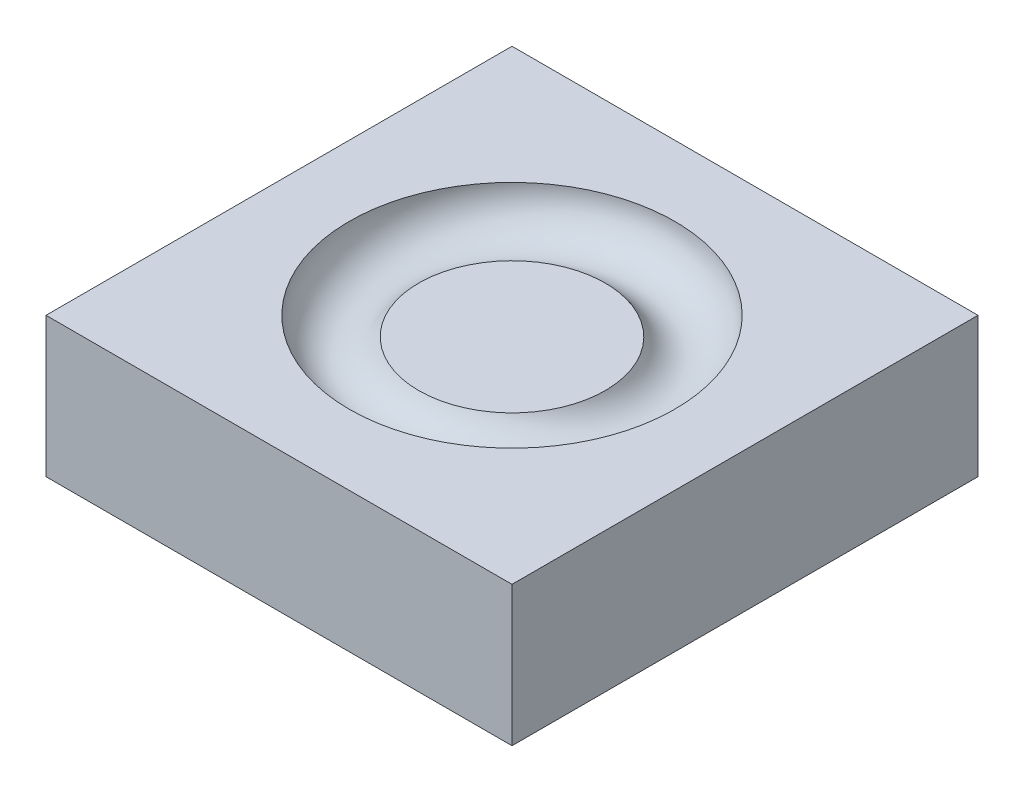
ISO-10303-21;
HEADER;
FILE_DESCRIPTION(('STEP AP214'),'2;1');
FILE_NAME('part.step','',(''),(''),'','','');
FILE_SCHEMA(('AUTOMOTIVE_DESIGN { 1 0 10303 214 1 1 1 1 }'));
ENDSEC;
DATA;
#1=APPLICATION_CONTEXT('core data for automotive mechanical design processes');
#2=APPLICATION_PROTOCOL_DEFINITION('international standard','automotive_design',2000,#1);
#3=PRODUCT_CONTEXT('',#1,'mechanical');
#4=PRODUCT('Part','Part','',(#3));
#5=PRODUCT_RELATED_PRODUCT_CATEGORY('part','',(#4));
#6=PRODUCT_DEFINITION_FORMATION('','',#4);
#7=PRODUCT_DEFINITION_CONTEXT('part definition',#1,'design');
#8=PRODUCT_DEFINITION('design','',#6,#7);
#9=PRODUCT_DEFINITION_SHAPE('','',#8);
#10=(LENGTH_UNIT() NAMED_UNIT(*) SI_UNIT(.MILLI.,.METRE.));
#11=(NAMED_UNIT(*) PLANE_ANGLE_UNIT() SI_UNIT($,.RADIAN.));
#12=(NAMED_UNIT(*) SI_UNIT($,.STERADIAN.) SOLID_ANGLE_UNIT());
#13=UNCERTAINTY_MEASURE_WITH_UNIT(LENGTH_MEASURE(1.E-05),#10,'distance_accuracy_value','');
#14=(GEOMETRIC_REPRESENTATION_CONTEXT(3) GLOBAL_UNCERTAINTY_ASSIGNED_CONTEXT((#13)) GLOBAL_UNIT_ASSIGNED_CONTEXT((#10,
#11,#12)) REPRESENTATION_CONTEXT('',''));
#15=CARTESIAN_POINT('',(0.,0.,0.));
#16=DIRECTION('',(0.,0.,1.));
#17=DIRECTION('',(1.,0.,0.));
#18=AXIS2_PLACEMENT_3D('',#15,#16,#17);
#19=CARTESIAN_POINT('',(0.,-110.,0.));
#20=DIRECTION('',(0.,-1.,0.));
#21=DIRECTION('',(0.,0.,-1.));
#22=AXIS2_PLACEMENT_3D('',#19,#20,#21);
#23=PLANE('',#22);
#24=DIRECTION('',(0.,0.,1.));
#25=VECTOR('',#24,1.);
#26=CARTESIAN_POINT('',(50.,-110.,50.));
#27=LINE('',#26,#25);
#28=CARTESIAN_POINT('',(50.,-110.,-50.));
#29=VERTEX_POINT('',#28);
#30=CARTESIAN_POINT('',(50.,-110.,50.));
#31=VERTEX_POINT('',#30);
#32=EDGE_CURVE('E79',#29,#31,#27,.T.);
#33=ORIENTED_EDGE('',*,*,#32,.T.);
#34=DIRECTION('',(-1.,0.,0.));
#35=VECTOR('',#34,1.);
#36=CARTESIAN_POINT('',(-50.,-110.,50.));
#37=LINE('',#36,#35);
#38=CARTESIAN_POINT('',(-50.,-110.,50.));
#39=VERTEX_POINT('',#38);
#40=EDGE_CURVE('E86',#31,#39,#37,.T.);
#41=ORIENTED_EDGE('',*,*,#40,.T.);
#42=DIRECTION('',(0.,0.,-1.));
#43=VECTOR('',#42,1.);
#44=CARTESIAN_POINT('',(-50.,-110.,50.));
#45=LINE('',#44,#43);
#46=CARTESIAN_POINT('',(-50.,-110.,-50.));
#47=VERTEX_POINT('',#46);
#48=EDGE_CURVE('E92',#39,#47,#45,.T.);
#49=ORIENTED_EDGE('',*,*,#48,.T.);
#50=DIRECTION('',(1.,0.,0.));
#51=VECTOR('',#50,1.);
#52=CARTESIAN_POINT('',(-50.,-110.,-50.));
#53=LINE('',#52,#51);
#54=EDGE_CURVE('E84',#47,#29,#53,.T.);
#55=ORIENTED_EDGE('',*,*,#54,.T.);
#56=EDGE_LOOP('',(#33,#41,#49,#55));
#57=FACE_BOUND('',#56,.T.);
#58=ADVANCED_FACE('F36',(#57),#23,.T.);
#59=CARTESIAN_POINT('',(-50.,-50.,50.));
#60=DIRECTION('',(0.,0.,1.));
#61=DIRECTION('',(1.,0.,0.));
#62=AXIS2_PLACEMENT_3D('',#59,#60,#61);
#63=PLANE('',#62);
#64=DIRECTION('',(0.,-1.,0.));
#65=VECTOR('',#64,1.);
#66=CARTESIAN_POINT('',(50.,-50.,50.));
#67=LINE('',#66,#65);
#68=CARTESIAN_POINT('',(50.,-80.,50.));
#69=VERTEX_POINT('',#68);
#70=EDGE_CURVE('E75',#69,#31,#67,.T.);
#71=ORIENTED_EDGE('',*,*,#70,.F.);
#72=DIRECTION('',(-1.,0.,0.));
#73=VECTOR('',#72,1.);
#74=CARTESIAN_POINT('',(-50.,-80.,50.));
#75=LINE('',#74,#73);
#76=CARTESIAN_POINT('',(-50.,-80.,50.));
#77=VERTEX_POINT('',#76);
#78=EDGE_CURVE('E40',#69,#77,#75,.T.);
#79=ORIENTED_EDGE('',*,*,#78,.T.);
#80=DIRECTION('',(0.,-1.,0.));
#81=VECTOR('',#80,1.);
#82=CARTESIAN_POINT('',(-50.,-50.,50.));
#83=LINE('',#82,#81);
#84=EDGE_CURVE('E83',#77,#39,#83,.T.);
#85=ORIENTED_EDGE('',*,*,#84,.T.);
#86=ORIENTED_EDGE('',*,*,#40,.F.);
#87=EDGE_LOOP('',(#71,#79,#85,#86));
#88=FACE_BOUND('',#87,.T.);
#89=ADVANCED_FACE('F87',(#88),#63,.T.);
#90=CARTESIAN_POINT('',(-50.,-50.,50.));
#91=DIRECTION('',(-1.,0.,0.));
#92=DIRECTION('',(0.,0.,1.));
#93=AXIS2_PLACEMENT_3D('',#90,#91,#92);
#94=PLANE('',#93);
#95=ORIENTED_EDGE('',*,*,#84,.F.);
#96=DIRECTION('',(0.,0.,-1.));
#97=VECTOR('',#96,1.);
#98=CARTESIAN_POINT('',(-50.,-80.,50.));
#99=LINE('',#98,#97);
#100=CARTESIAN_POINT('',(-50.,-80.,-50.));
#101=VERTEX_POINT('',#100);
#102=EDGE_CURVE('E109',#77,#101,#99,.T.);
#103=ORIENTED_EDGE('',*,*,#102,.T.);
#104=DIRECTION('',(0.,-1.,0.));
#105=VECTOR('',#104,1.);
#106=CARTESIAN_POINT('',(-50.,-50.,-50.));
#107=LINE('',#106,#105);
#108=EDGE_CURVE('E103',#101,#47,#107,.T.);
#109=ORIENTED_EDGE('',*,*,#108,.T.);
#110=ORIENTED_EDGE('',*,*,#48,.F.);
#111=EDGE_LOOP('',(#95,#103,#109,#110));
#112=FACE_BOUND('',#111,.T.);
#113=ADVANCED_FACE('F108',(#112),#94,.T.);
#114=CARTESIAN_POINT('',(-50.,-50.,-50.));
#115=DIRECTION('',(0.,0.,-1.));
#116=DIRECTION('',(-1.,0.,0.));
#117=AXIS2_PLACEMENT_3D('',#114,#115,#116);
#118=PLANE('',#117);
#119=ORIENTED_EDGE('',*,*,#108,.F.);
#120=DIRECTION('',(1.,0.,0.));
#121=VECTOR('',#120,1.);
#122=CARTESIAN_POINT('',(-50.,-80.,-50.));
#123=LINE('',#122,#121);
#124=CARTESIAN_POINT('',(50.,-80.,-50.));
#125=VERTEX_POINT('',#124);
#126=EDGE_CURVE('E113',#101,#125,#123,.T.);
#127=ORIENTED_EDGE('',*,*,#126,.T.);
#128=DIRECTION('',(0.,-1.,0.));
#129=VECTOR('',#128,1.);
#130=CARTESIAN_POINT('',(50.,-50.,-50.));
#131=LINE('',#130,#129);
#132=EDGE_CURVE('E101',#125,#29,#131,.T.);
#133=ORIENTED_EDGE('',*,*,#132,.T.);
#134=ORIENTED_EDGE('',*,*,#54,.F.);
#135=EDGE_LOOP('',(#119,#127,#133,#134));
#136=FACE_BOUND('',#135,.T.);
#137=ADVANCED_FACE('F112',(#136),#118,.T.);
#138=CARTESIAN_POINT('',(50.,-50.,50.));
#139=DIRECTION('',(1.,0.,0.));
#140=DIRECTION('',(0.,0.,-1.));
#141=AXIS2_PLACEMENT_3D('',#138,#139,#140);
#142=PLANE('',#141);
#143=ORIENTED_EDGE('',*,*,#132,.F.);
#144=DIRECTION('',(0.,0.,1.));
#145=VECTOR('',#144,1.);
#146=CARTESIAN_POINT('',(50.,-80.,50.));
#147=LINE('',#146,#145);
#148=EDGE_CURVE('E81',#125,#69,#147,.T.);
#149=ORIENTED_EDGE('',*,*,#148,.T.);
#150=ORIENTED_EDGE('',*,*,#70,.T.);
#151=ORIENTED_EDGE('',*,*,#32,.F.);
#152=EDGE_LOOP('',(#143,#149,#150,#151));
#153=FACE_BOUND('',#152,.T.);
#154=ADVANCED_FACE('F38',(#153),#142,.T.);
#155=CARTESIAN_POINT('',(0.,-84.,0.));
#156=DIRECTION('',(0.,-1.,0.));
#157=DIRECTION('',(0.,0.,-1.));
#158=AXIS2_PLACEMENT_3D('',#155,#156,#157);
#159=PLANE('',#158);
#160=CARTESIAN_POINT('',(0.,-84.,0.));
#161=DIRECTION('',(0.,1.,0.));
#162=DIRECTION('',(0.,0.,1.));
#163=AXIS2_PLACEMENT_3D('',#160,#161,#162);
#164=CIRCLE('',#163,20.);
#165=CARTESIAN_POINT('',(0.,-84.,20.));
#166=VERTEX_POINT('',#165);
#167=EDGE_CURVE('E47',#166,#166,#164,.T.);
#168=ORIENTED_EDGE('',*,*,#167,.T.);
#169=EDGE_LOOP('',(#168));
#170=FACE_BOUND('',#169,.T.);
#171=ADVANCED_FACE('F119',(#170),#159,.F.);
#172=CARTESIAN_POINT('',(0.,-80.,0.));
#173=DIRECTION('',(0.,1.,0.));
#174=DIRECTION('',(0.,0.,1.));
#175=AXIS2_PLACEMENT_3D('',#172,#173,#174);
#176=TOROIDAL_SURFACE('',#175,26.9282032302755,8.);
#177=ORIENTED_EDGE('',*,*,#167,.F.);
#178=EDGE_LOOP('',(#177));
#179=FACE_BOUND('',#178,.T.);
#180=CARTESIAN_POINT('',(0.,-80.,0.));
#181=DIRECTION('',(0.,1.,0.));
#182=DIRECTION('',(0.,0.,1.));
#183=AXIS2_PLACEMENT_3D('',#180,#181,#182);
#184=CIRCLE('',#183,34.9282032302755);
#185=CARTESIAN_POINT('',(0.,-80.,34.9282032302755));
#186=VERTEX_POINT('',#185);
#187=EDGE_CURVE('E11',#186,#186,#184,.F.);
#188=ORIENTED_EDGE('',*,*,#187,.F.);
#189=EDGE_LOOP('',(#188));
#190=FACE_BOUND('',#189,.T.);
#191=ADVANCED_FACE('F121',(#179,#190),#176,.F.);
#192=CARTESIAN_POINT('',(-0.725366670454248,-80.,-34.9282043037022));
#193=DIRECTION('',(0.,1.,0.));
#194=DIRECTION('',(0.999999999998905,0.,1.47984010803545E-06));
#195=AXIS2_PLACEMENT_3D('',#192,#193,#194);
#196=PLANE('',#195);
#197=ORIENTED_EDGE('',*,*,#126,.F.);
#198=ORIENTED_EDGE('',*,*,#102,.F.);
#199=ORIENTED_EDGE('',*,*,#78,.F.);
#200=ORIENTED_EDGE('',*,*,#148,.F.);
#201=EDGE_LOOP('',(#197,#198,#199,#200));
#202=FACE_BOUND('',#201,.T.);
#203=ORIENTED_EDGE('',*,*,#187,.T.);
#204=EDGE_LOOP('',(#203));
#205=FACE_BOUND('',#204,.T.);
#206=ADVANCED_FACE('F124',(#202,#205),#196,.T.);
#207=CLOSED_SHELL('',(#58,#89,#113,#137,#154,#171,#191,#206));
#208=MANIFOLD_SOLID_BREP('B2',#207);
#209=ADVANCED_BREP_SHAPE_REPRESENTATION('',(#18,#208),#14);
#210=SHAPE_DEFINITION_REPRESENTATION(#9,#209);
ENDSEC;
END-ISO-10303-21;
